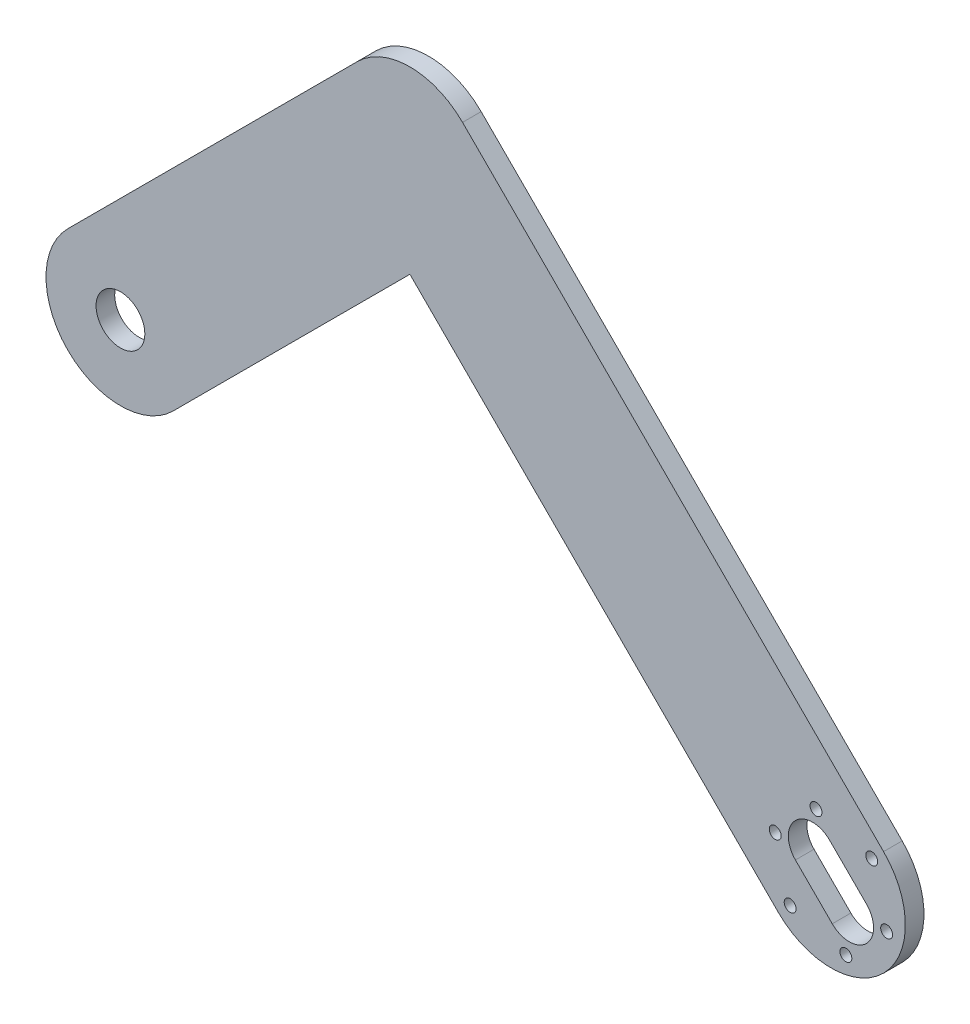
ISO-10303-21;
HEADER;
FILE_DESCRIPTION(('STEP AP214'),'2;1');
FILE_NAME('part.step','',(''),(''),'','','');
FILE_SCHEMA(('AUTOMOTIVE_DESIGN { 1 0 10303 214 1 1 1 1 }'));
ENDSEC;
DATA;
#1=APPLICATION_CONTEXT('core data for automotive mechanical design processes');
#2=APPLICATION_PROTOCOL_DEFINITION('international standard','automotive_design',2000,#1);
#3=PRODUCT_CONTEXT('',#1,'mechanical');
#4=PRODUCT('Part','Part','',(#3));
#5=PRODUCT_RELATED_PRODUCT_CATEGORY('part','',(#4));
#6=PRODUCT_DEFINITION_FORMATION('','',#4);
#7=PRODUCT_DEFINITION_CONTEXT('part definition',#1,'design');
#8=PRODUCT_DEFINITION('design','',#6,#7);
#9=PRODUCT_DEFINITION_SHAPE('','',#8);
#10=(LENGTH_UNIT() NAMED_UNIT(*) SI_UNIT(.MILLI.,.METRE.));
#11=(NAMED_UNIT(*) PLANE_ANGLE_UNIT() SI_UNIT($,.RADIAN.));
#12=(NAMED_UNIT(*) SI_UNIT($,.STERADIAN.) SOLID_ANGLE_UNIT());
#13=UNCERTAINTY_MEASURE_WITH_UNIT(LENGTH_MEASURE(1.E-05),#10,'distance_accuracy_value','');
#14=(GEOMETRIC_REPRESENTATION_CONTEXT(3) GLOBAL_UNCERTAINTY_ASSIGNED_CONTEXT((#13)) GLOBAL_UNIT_ASSIGNED_CONTEXT((#10,
#11,#12)) REPRESENTATION_CONTEXT('',''));
#15=CARTESIAN_POINT('',(0.,0.,0.));
#16=DIRECTION('',(0.,0.,1.));
#17=DIRECTION('',(1.,0.,0.));
#18=AXIS2_PLACEMENT_3D('',#15,#16,#17);
#19=CARTESIAN_POINT('',(63.6396103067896,63.639610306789,5.));
#20=DIRECTION('',(0.707106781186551,0.707106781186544,0.));
#21=DIRECTION('',(-0.707106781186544,0.707106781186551,0.));
#22=AXIS2_PLACEMENT_3D('',#19,#20,#21);
#23=PLANE('',#22);
#24=DIRECTION('',(0.707106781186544,-0.707106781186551,0.));
#25=VECTOR('',#24,1.);
#26=CARTESIAN_POINT('',(63.6396103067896,63.639610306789,0.));
#27=LINE('',#26,#25);
#28=CARTESIAN_POINT('',(77.7817459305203,49.4974746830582,0.));
#29=VERTEX_POINT('',#28);
#30=CARTESIAN_POINT('',(176.776695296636,-49.4974746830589,0.));
#31=VERTEX_POINT('',#30);
#32=EDGE_CURVE('E226',#29,#31,#27,.T.);
#33=ORIENTED_EDGE('',*,*,#32,.T.);
#34=DIRECTION('',(0.,0.,-1.));
#35=VECTOR('',#34,1.);
#36=CARTESIAN_POINT('',(176.776695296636,-49.4974746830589,5.));
#37=LINE('',#36,#35);
#38=CARTESIAN_POINT('',(176.776695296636,-49.4974746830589,5.));
#39=VERTEX_POINT('',#38);
#40=EDGE_CURVE('E77',#39,#31,#37,.T.);
#41=ORIENTED_EDGE('',*,*,#40,.F.);
#42=DIRECTION('',(0.707106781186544,-0.707106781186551,0.));
#43=VECTOR('',#42,1.);
#44=CARTESIAN_POINT('',(63.6396103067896,63.639610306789,5.));
#45=LINE('',#44,#43);
#46=CARTESIAN_POINT('',(77.7817459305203,49.4974746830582,5.));
#47=VERTEX_POINT('',#46);
#48=EDGE_CURVE('E211',#47,#39,#45,.T.);
#49=ORIENTED_EDGE('',*,*,#48,.F.);
#50=DIRECTION('',(0.,0.,-1.));
#51=VECTOR('',#50,1.);
#52=CARTESIAN_POINT('',(77.7817459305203,49.4974746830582,5.));
#53=LINE('',#52,#51);
#54=EDGE_CURVE('E12',#47,#29,#53,.T.);
#55=ORIENTED_EDGE('',*,*,#54,.T.);
#56=EDGE_LOOP('',(#33,#41,#49,#55));
#57=FACE_BOUND('',#56,.T.);
#58=ADVANCED_FACE('F69',(#57),#23,.F.);
#59=CARTESIAN_POINT('',(190.918830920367,-35.3553390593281,5.));
#60=DIRECTION('',(0.,0.,-1.));
#61=DIRECTION('',(-1.,0.,0.));
#62=AXIS2_PLACEMENT_3D('',#59,#60,#61);
#63=CYLINDRICAL_SURFACE('',#62,19.9999999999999);
#64=CARTESIAN_POINT('',(190.918830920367,-35.3553390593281,0.));
#65=DIRECTION('',(0.,0.,1.));
#66=DIRECTION('',(1.,0.,0.));
#67=AXIS2_PLACEMENT_3D('',#64,#65,#66);
#68=CIRCLE('',#67,19.9999999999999);
#69=CARTESIAN_POINT('',(205.060966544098,-21.2132034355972,0.));
#70=VERTEX_POINT('',#69);
#71=EDGE_CURVE('E233',#31,#70,#68,.T.);
#72=ORIENTED_EDGE('',*,*,#71,.T.);
#73=DIRECTION('',(0.,0.,-1.));
#74=VECTOR('',#73,1.);
#75=CARTESIAN_POINT('',(205.060966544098,-21.2132034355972,5.));
#76=LINE('',#75,#74);
#77=CARTESIAN_POINT('',(205.060966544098,-21.2132034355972,5.));
#78=VERTEX_POINT('',#77);
#79=EDGE_CURVE('E248',#78,#70,#76,.T.);
#80=ORIENTED_EDGE('',*,*,#79,.F.);
#81=CARTESIAN_POINT('',(190.918830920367,-35.3553390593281,5.));
#82=DIRECTION('',(0.,0.,1.));
#83=DIRECTION('',(1.,0.,0.));
#84=AXIS2_PLACEMENT_3D('',#81,#82,#83);
#85=CIRCLE('',#84,19.9999999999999);
#86=EDGE_CURVE('E213',#39,#78,#85,.T.);
#87=ORIENTED_EDGE('',*,*,#86,.F.);
#88=ORIENTED_EDGE('',*,*,#40,.T.);
#89=EDGE_LOOP('',(#72,#80,#87,#88));
#90=FACE_BOUND('',#89,.T.);
#91=ADVANCED_FACE('F276',(#90),#63,.T.);
#92=CARTESIAN_POINT('',(91.9238815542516,91.9238815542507,5.));
#93=DIRECTION('',(0.707106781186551,0.707106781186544,0.));
#94=DIRECTION('',(-0.707106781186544,0.707106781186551,0.));
#95=AXIS2_PLACEMENT_3D('',#92,#93,#94);
#96=PLANE('',#95);
#97=DIRECTION('',(0.707106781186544,-0.707106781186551,0.));
#98=VECTOR('',#97,1.);
#99=CARTESIAN_POINT('',(91.9238815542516,91.9238815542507,0.));
#100=LINE('',#99,#98);
#101=CARTESIAN_POINT('',(91.9238815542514,91.923881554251,0.));
#102=VERTEX_POINT('',#101);
#103=EDGE_CURVE('E234',#102,#70,#100,.T.);
#104=ORIENTED_EDGE('',*,*,#103,.F.);
#105=DIRECTION('',(0.,0.,-1.));
#106=VECTOR('',#105,1.);
#107=CARTESIAN_POINT('',(91.9238815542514,91.923881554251,5.));
#108=LINE('',#107,#106);
#109=CARTESIAN_POINT('',(91.9238815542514,91.923881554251,5.));
#110=VERTEX_POINT('',#109);
#111=EDGE_CURVE('E250',#110,#102,#108,.T.);
#112=ORIENTED_EDGE('',*,*,#111,.F.);
#113=DIRECTION('',(0.707106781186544,-0.707106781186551,0.));
#114=VECTOR('',#113,1.);
#115=CARTESIAN_POINT('',(91.9238815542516,91.9238815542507,5.));
#116=LINE('',#115,#114);
#117=EDGE_CURVE('E217',#110,#78,#116,.T.);
#118=ORIENTED_EDGE('',*,*,#117,.T.);
#119=ORIENTED_EDGE('',*,*,#79,.T.);
#120=EDGE_LOOP('',(#104,#112,#118,#119));
#121=FACE_BOUND('',#120,.T.);
#122=ADVANCED_FACE('F271',(#121),#96,.T.);
#123=CARTESIAN_POINT('',(-14.1421356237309,14.142135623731,5.));
#124=DIRECTION('',(-0.707106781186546,0.707106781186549,0.));
#125=DIRECTION('',(-0.707106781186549,-0.707106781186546,0.));
#126=AXIS2_PLACEMENT_3D('',#123,#124,#125);
#127=PLANE('',#126);
#128=DIRECTION('',(0.707106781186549,0.707106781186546,0.));
#129=VECTOR('',#128,1.);
#130=CARTESIAN_POINT('',(-14.1421356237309,14.142135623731,0.));
#131=LINE('',#130,#129);
#132=CARTESIAN_POINT('',(-14.1421356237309,14.142135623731,0.));
#133=VERTEX_POINT('',#132);
#134=CARTESIAN_POINT('',(63.6396103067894,91.9238815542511,0.));
#135=VERTEX_POINT('',#134);
#136=EDGE_CURVE('E240',#133,#135,#131,.T.);
#137=ORIENTED_EDGE('',*,*,#136,.F.);
#138=DIRECTION('',(0.,0.,-1.));
#139=VECTOR('',#138,1.);
#140=CARTESIAN_POINT('',(-14.1421356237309,14.142135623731,5.));
#141=LINE('',#140,#139);
#142=CARTESIAN_POINT('',(-14.1421356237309,14.142135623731,5.));
#143=VERTEX_POINT('',#142);
#144=EDGE_CURVE('E243',#143,#133,#141,.T.);
#145=ORIENTED_EDGE('',*,*,#144,.F.);
#146=DIRECTION('',(0.707106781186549,0.707106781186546,0.));
#147=VECTOR('',#146,1.);
#148=CARTESIAN_POINT('',(-14.1421356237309,14.142135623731,5.));
#149=LINE('',#148,#147);
#150=CARTESIAN_POINT('',(63.6396103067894,91.9238815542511,5.));
#151=VERTEX_POINT('',#150);
#152=EDGE_CURVE('E216',#143,#151,#149,.T.);
#153=ORIENTED_EDGE('',*,*,#152,.T.);
#154=DIRECTION('',(0.,0.,-1.));
#155=VECTOR('',#154,1.);
#156=CARTESIAN_POINT('',(63.6396103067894,91.9238815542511,5.));
#157=LINE('',#156,#155);
#158=EDGE_CURVE('E244',#151,#135,#157,.T.);
#159=ORIENTED_EDGE('',*,*,#158,.T.);
#160=EDGE_LOOP('',(#137,#145,#153,#159));
#161=FACE_BOUND('',#160,.T.);
#162=ADVANCED_FACE('F263',(#161),#127,.T.);
#163=CARTESIAN_POINT('',(0.,0.,5.));
#164=DIRECTION('',(0.,0.,-1.));
#165=DIRECTION('',(-1.,0.,0.));
#166=AXIS2_PLACEMENT_3D('',#163,#164,#165);
#167=CYLINDRICAL_SURFACE('',#166,20.);
#168=CARTESIAN_POINT('',(0.,0.,0.));
#169=DIRECTION('',(0.,0.,1.));
#170=DIRECTION('',(1.,0.,0.));
#171=AXIS2_PLACEMENT_3D('',#168,#169,#170);
#172=CIRCLE('',#171,20.);
#173=CARTESIAN_POINT('',(14.1421356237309,-14.142135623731,0.));
#174=VERTEX_POINT('',#173);
#175=EDGE_CURVE('E215',#133,#174,#172,.T.);
#176=ORIENTED_EDGE('',*,*,#175,.T.);
#177=DIRECTION('',(0.,0.,-1.));
#178=VECTOR('',#177,1.);
#179=CARTESIAN_POINT('',(14.1421356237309,-14.142135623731,5.));
#180=LINE('',#179,#178);
#181=CARTESIAN_POINT('',(14.1421356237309,-14.142135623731,5.));
#182=VERTEX_POINT('',#181);
#183=EDGE_CURVE('E224',#182,#174,#180,.T.);
#184=ORIENTED_EDGE('',*,*,#183,.F.);
#185=CARTESIAN_POINT('',(0.,0.,5.));
#186=DIRECTION('',(0.,0.,1.));
#187=DIRECTION('',(1.,0.,0.));
#188=AXIS2_PLACEMENT_3D('',#185,#186,#187);
#189=CIRCLE('',#188,20.);
#190=EDGE_CURVE('E225',#143,#182,#189,.T.);
#191=ORIENTED_EDGE('',*,*,#190,.F.);
#192=ORIENTED_EDGE('',*,*,#144,.T.);
#193=EDGE_LOOP('',(#176,#184,#191,#192));
#194=FACE_BOUND('',#193,.T.);
#195=ADVANCED_FACE('F281',(#194),#167,.T.);
#196=CARTESIAN_POINT('',(14.1421356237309,-14.142135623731,5.));
#197=DIRECTION('',(-0.707106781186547,0.707106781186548,0.));
#198=DIRECTION('',(-0.707106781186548,-0.707106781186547,0.));
#199=AXIS2_PLACEMENT_3D('',#196,#197,#198);
#200=PLANE('',#199);
#201=DIRECTION('',(0.707106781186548,0.707106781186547,0.));
#202=VECTOR('',#201,1.);
#203=CARTESIAN_POINT('',(14.1421356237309,-14.142135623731,0.));
#204=LINE('',#203,#202);
#205=EDGE_CURVE('E222',#174,#29,#204,.T.);
#206=ORIENTED_EDGE('',*,*,#205,.T.);
#207=ORIENTED_EDGE('',*,*,#54,.F.);
#208=DIRECTION('',(0.707106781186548,0.707106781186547,0.));
#209=VECTOR('',#208,1.);
#210=CARTESIAN_POINT('',(14.1421356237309,-14.142135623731,5.));
#211=LINE('',#210,#209);
#212=EDGE_CURVE('E206',#182,#47,#211,.T.);
#213=ORIENTED_EDGE('',*,*,#212,.F.);
#214=ORIENTED_EDGE('',*,*,#183,.T.);
#215=EDGE_LOOP('',(#206,#207,#213,#214));
#216=FACE_BOUND('',#215,.T.);
#217=ADVANCED_FACE('F284',(#216),#200,.F.);
#218=CARTESIAN_POINT('',(0.,0.,0.));
#219=DIRECTION('',(0.,0.,1.));
#220=DIRECTION('',(1.,0.,0.));
#221=AXIS2_PLACEMENT_3D('',#218,#219,#220);
#222=PLANE('',#221);
#223=CARTESIAN_POINT('',(0.,0.,0.));
#224=DIRECTION('',(0.,0.,-1.));
#225=DIRECTION('',(-1.,0.,0.));
#226=AXIS2_PLACEMENT_3D('',#223,#224,#225);
#227=CIRCLE('',#226,6.55);
#228=CARTESIAN_POINT('',(-6.55,0.,0.));
#229=VERTEX_POINT('',#228);
#230=EDGE_CURVE('E522',#229,#229,#227,.T.);
#231=ORIENTED_EDGE('',*,*,#230,.F.);
#232=EDGE_LOOP('',(#231));
#233=FACE_BOUND('',#232,.T.);
#234=CARTESIAN_POINT('',(186.907135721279,-20.3834887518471,0.));
#235=DIRECTION('',(0.,0.,1.));
#236=DIRECTION('',(1.,0.,0.));
#237=AXIS2_PLACEMENT_3D('',#234,#235,#236);
#238=CIRCLE('',#237,1.6);
#239=CARTESIAN_POINT('',(188.507135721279,-20.3834887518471,0.));
#240=VERTEX_POINT('',#239);
#241=EDGE_CURVE('E204',#240,#240,#238,.T.);
#242=ORIENTED_EDGE('',*,*,#241,.T.);
#243=EDGE_LOOP('',(#242));
#244=FACE_BOUND('',#243,.T.);
#245=CARTESIAN_POINT('',(201.87898602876,-24.3951839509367,0.));
#246=DIRECTION('',(0.,0.,1.));
#247=DIRECTION('',(1.,0.,0.));
#248=AXIS2_PLACEMENT_3D('',#245,#246,#247);
#249=CIRCLE('',#248,1.6);
#250=CARTESIAN_POINT('',(203.47898602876,-24.3951839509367,0.));
#251=VERTEX_POINT('',#250);
#252=EDGE_CURVE('E203',#251,#251,#249,.T.);
#253=ORIENTED_EDGE('',*,*,#252,.T.);
#254=EDGE_LOOP('',(#253));
#255=FACE_BOUND('',#254,.T.);
#256=CARTESIAN_POINT('',(205.890681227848,-39.3670342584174,0.));
#257=DIRECTION('',(0.,0.,1.));
#258=DIRECTION('',(1.,0.,0.));
#259=AXIS2_PLACEMENT_3D('',#256,#257,#258);
#260=CIRCLE('',#259,1.59999999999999);
#261=CARTESIAN_POINT('',(207.490681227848,-39.3670342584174,0.));
#262=VERTEX_POINT('',#261);
#263=EDGE_CURVE('E200',#262,#262,#260,.T.);
#264=ORIENTED_EDGE('',*,*,#263,.T.);
#265=EDGE_LOOP('',(#264));
#266=FACE_BOUND('',#265,.T.);
#267=CARTESIAN_POINT('',(194.930526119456,-50.3271893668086,0.));
#268=DIRECTION('',(0.,0.,1.));
#269=DIRECTION('',(1.,0.,0.));
#270=AXIS2_PLACEMENT_3D('',#267,#268,#269);
#271=CIRCLE('',#270,1.6);
#272=CARTESIAN_POINT('',(196.530526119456,-50.3271893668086,0.));
#273=VERTEX_POINT('',#272);
#274=EDGE_CURVE('E194',#273,#273,#271,.T.);
#275=ORIENTED_EDGE('',*,*,#274,.T.);
#276=EDGE_LOOP('',(#275));
#277=FACE_BOUND('',#276,.T.);
#278=CARTESIAN_POINT('',(179.958675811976,-46.3154941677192,0.));
#279=DIRECTION('',(0.,0.,1.));
#280=DIRECTION('',(1.,0.,0.));
#281=AXIS2_PLACEMENT_3D('',#278,#279,#280);
#282=CIRCLE('',#281,1.59999999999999);
#283=CARTESIAN_POINT('',(181.558675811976,-46.3154941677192,0.));
#284=VERTEX_POINT('',#283);
#285=EDGE_CURVE('E195',#284,#284,#282,.T.);
#286=ORIENTED_EDGE('',*,*,#285,.T.);
#287=EDGE_LOOP('',(#286));
#288=FACE_BOUND('',#287,.T.);
#289=CARTESIAN_POINT('',(175.946980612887,-31.3436438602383,0.));
#290=DIRECTION('',(0.,0.,1.));
#291=DIRECTION('',(1.,0.,0.));
#292=AXIS2_PLACEMENT_3D('',#289,#290,#291);
#293=CIRCLE('',#292,1.60000000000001);
#294=CARTESIAN_POINT('',(177.546980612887,-31.3436438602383,0.));
#295=VERTEX_POINT('',#294);
#296=EDGE_CURVE('E186',#295,#295,#293,.T.);
#297=ORIENTED_EDGE('',*,*,#296,.T.);
#298=EDGE_LOOP('',(#297));
#299=FACE_BOUND('',#298,.T.);
#300=DIRECTION('',(-0.707106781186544,0.707106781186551,0.));
#301=VECTOR('',#300,1.);
#302=CARTESIAN_POINT('',(82.3779400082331,82.3779400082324,0.));
#303=LINE('',#302,#301);
#304=CARTESIAN_POINT('',(200.464772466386,-35.7088924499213,0.));
#305=VERTEX_POINT('',#304);
#306=CARTESIAN_POINT('',(190.565277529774,-25.8093975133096,0.));
#307=VERTEX_POINT('',#306);
#308=EDGE_CURVE('E182',#305,#307,#303,.T.);
#309=ORIENTED_EDGE('',*,*,#308,.T.);
#310=CARTESIAN_POINT('',(185.969083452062,-30.4055915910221,0.));
#311=DIRECTION('',(0.,0.,1.));
#312=DIRECTION('',(1.,0.,0.));
#313=AXIS2_PLACEMENT_3D('',#310,#311,#312);
#314=CIRCLE('',#313,6.5);
#315=CARTESIAN_POINT('',(181.372889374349,-35.0017856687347,0.));
#316=VERTEX_POINT('',#315);
#317=EDGE_CURVE('E187',#307,#316,#314,.T.);
#318=ORIENTED_EDGE('',*,*,#317,.T.);
#319=DIRECTION('',(0.707106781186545,-0.707106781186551,0.));
#320=VECTOR('',#319,1.);
#321=CARTESIAN_POINT('',(73.1855518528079,73.1855518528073,0.));
#322=LINE('',#321,#320);
#323=CARTESIAN_POINT('',(191.272384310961,-44.9012806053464,0.));
#324=VERTEX_POINT('',#323);
#325=EDGE_CURVE('E178',#316,#324,#322,.T.);
#326=ORIENTED_EDGE('',*,*,#325,.T.);
#327=CARTESIAN_POINT('',(195.868578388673,-40.3050865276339,0.));
#328=DIRECTION('',(0.,0.,1.));
#329=DIRECTION('',(1.,0.,0.));
#330=AXIS2_PLACEMENT_3D('',#327,#328,#329);
#331=CIRCLE('',#330,6.5);
#332=EDGE_CURVE('E156',#324,#305,#331,.T.);
#333=ORIENTED_EDGE('',*,*,#332,.T.);
#334=EDGE_LOOP('',(#309,#318,#326,#333));
#335=FACE_BOUND('',#334,.T.);
#336=ORIENTED_EDGE('',*,*,#205,.F.);
#337=ORIENTED_EDGE('',*,*,#175,.F.);
#338=ORIENTED_EDGE('',*,*,#136,.T.);
#339=CARTESIAN_POINT('',(77.7817459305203,77.7817459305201,0.));
#340=DIRECTION('',(0.,0.,1.));
#341=DIRECTION('',(1.,0.,0.));
#342=AXIS2_PLACEMENT_3D('',#339,#340,#341);
#343=CIRCLE('',#342,20.);
#344=EDGE_CURVE('E210',#102,#135,#343,.T.);
#345=ORIENTED_EDGE('',*,*,#344,.F.);
#346=ORIENTED_EDGE('',*,*,#103,.T.);
#347=ORIENTED_EDGE('',*,*,#71,.F.);
#348=ORIENTED_EDGE('',*,*,#32,.F.);
#349=EDGE_LOOP('',(#336,#337,#338,#345,#346,#347,#348));
#350=FACE_BOUND('',#349,.T.);
#351=ADVANCED_FACE('F265',(#233,#244,#255,#266,#277,#288,#299,#335,#350),#222,.F.);
#352=CARTESIAN_POINT('',(0.,0.,5.));
#353=DIRECTION('',(0.,0.,1.));
#354=DIRECTION('',(1.,0.,0.));
#355=AXIS2_PLACEMENT_3D('',#352,#353,#354);
#356=PLANE('',#355);
#357=CARTESIAN_POINT('',(0.,0.,5.));
#358=DIRECTION('',(0.,0.,1.));
#359=DIRECTION('',(1.,0.,0.));
#360=AXIS2_PLACEMENT_3D('',#357,#358,#359);
#361=CIRCLE('',#360,6.55);
#362=CARTESIAN_POINT('',(6.55,0.,5.));
#363=VERTEX_POINT('',#362);
#364=EDGE_CURVE('E73',#363,#363,#361,.T.);
#365=ORIENTED_EDGE('',*,*,#364,.F.);
#366=EDGE_LOOP('',(#365));
#367=FACE_BOUND('',#366,.T.);
#368=CARTESIAN_POINT('',(186.907135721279,-20.3834887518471,5.));
#369=DIRECTION('',(0.,0.,1.));
#370=DIRECTION('',(1.,0.,0.));
#371=AXIS2_PLACEMENT_3D('',#368,#369,#370);
#372=CIRCLE('',#371,1.6);
#373=CARTESIAN_POINT('',(188.507135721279,-20.3834887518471,5.));
#374=VERTEX_POINT('',#373);
#375=EDGE_CURVE('E525',#374,#374,#372,.T.);
#376=ORIENTED_EDGE('',*,*,#375,.F.);
#377=EDGE_LOOP('',(#376));
#378=FACE_BOUND('',#377,.T.);
#379=CARTESIAN_POINT('',(201.87898602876,-24.3951839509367,5.));
#380=DIRECTION('',(0.,0.,1.));
#381=DIRECTION('',(1.,0.,0.));
#382=AXIS2_PLACEMENT_3D('',#379,#380,#381);
#383=CIRCLE('',#382,1.6);
#384=CARTESIAN_POINT('',(203.47898602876,-24.3951839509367,5.));
#385=VERTEX_POINT('',#384);
#386=EDGE_CURVE('E540',#385,#385,#383,.T.);
#387=ORIENTED_EDGE('',*,*,#386,.F.);
#388=EDGE_LOOP('',(#387));
#389=FACE_BOUND('',#388,.T.);
#390=CARTESIAN_POINT('',(205.890681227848,-39.3670342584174,5.));
#391=DIRECTION('',(0.,0.,1.));
#392=DIRECTION('',(1.,0.,0.));
#393=AXIS2_PLACEMENT_3D('',#390,#391,#392);
#394=CIRCLE('',#393,1.59999999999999);
#395=CARTESIAN_POINT('',(207.490681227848,-39.3670342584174,5.));
#396=VERTEX_POINT('',#395);
#397=EDGE_CURVE('E534',#396,#396,#394,.T.);
#398=ORIENTED_EDGE('',*,*,#397,.F.);
#399=EDGE_LOOP('',(#398));
#400=FACE_BOUND('',#399,.T.);
#401=CARTESIAN_POINT('',(194.930526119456,-50.3271893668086,5.));
#402=DIRECTION('',(0.,0.,1.));
#403=DIRECTION('',(1.,0.,0.));
#404=AXIS2_PLACEMENT_3D('',#401,#402,#403);
#405=CIRCLE('',#404,1.6);
#406=CARTESIAN_POINT('',(196.530526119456,-50.3271893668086,5.));
#407=VERTEX_POINT('',#406);
#408=EDGE_CURVE('E532',#407,#407,#405,.T.);
#409=ORIENTED_EDGE('',*,*,#408,.F.);
#410=EDGE_LOOP('',(#409));
#411=FACE_BOUND('',#410,.T.);
#412=CARTESIAN_POINT('',(179.958675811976,-46.3154941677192,5.));
#413=DIRECTION('',(0.,0.,1.));
#414=DIRECTION('',(1.,0.,0.));
#415=AXIS2_PLACEMENT_3D('',#412,#413,#414);
#416=CIRCLE('',#415,1.59999999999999);
#417=CARTESIAN_POINT('',(181.558675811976,-46.3154941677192,5.));
#418=VERTEX_POINT('',#417);
#419=EDGE_CURVE('E526',#418,#418,#416,.T.);
#420=ORIENTED_EDGE('',*,*,#419,.F.);
#421=EDGE_LOOP('',(#420));
#422=FACE_BOUND('',#421,.T.);
#423=CARTESIAN_POINT('',(175.946980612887,-31.3436438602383,5.));
#424=DIRECTION('',(0.,0.,1.));
#425=DIRECTION('',(1.,0.,0.));
#426=AXIS2_PLACEMENT_3D('',#423,#424,#425);
#427=CIRCLE('',#426,1.60000000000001);
#428=CARTESIAN_POINT('',(177.546980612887,-31.3436438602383,5.));
#429=VERTEX_POINT('',#428);
#430=EDGE_CURVE('E523',#429,#429,#427,.T.);
#431=ORIENTED_EDGE('',*,*,#430,.F.);
#432=EDGE_LOOP('',(#431));
#433=FACE_BOUND('',#432,.T.);
#434=CARTESIAN_POINT('',(185.969083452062,-30.4055915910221,5.));
#435=DIRECTION('',(0.,0.,1.));
#436=DIRECTION('',(1.,0.,0.));
#437=AXIS2_PLACEMENT_3D('',#434,#435,#436);
#438=CIRCLE('',#437,6.5);
#439=CARTESIAN_POINT('',(190.565277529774,-25.8093975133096,5.));
#440=VERTEX_POINT('',#439);
#441=CARTESIAN_POINT('',(181.372889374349,-35.0017856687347,5.));
#442=VERTEX_POINT('',#441);
#443=EDGE_CURVE('E95',#440,#442,#438,.T.);
#444=ORIENTED_EDGE('',*,*,#443,.F.);
#445=DIRECTION('',(-0.707106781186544,0.707106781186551,0.));
#446=VECTOR('',#445,1.);
#447=CARTESIAN_POINT('',(190.565277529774,-25.8093975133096,5.));
#448=LINE('',#447,#446);
#449=CARTESIAN_POINT('',(200.464772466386,-35.7088924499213,5.));
#450=VERTEX_POINT('',#449);
#451=EDGE_CURVE('E171',#450,#440,#448,.T.);
#452=ORIENTED_EDGE('',*,*,#451,.F.);
#453=CARTESIAN_POINT('',(195.868578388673,-40.3050865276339,5.));
#454=DIRECTION('',(0.,0.,1.));
#455=DIRECTION('',(1.,0.,0.));
#456=AXIS2_PLACEMENT_3D('',#453,#454,#455);
#457=CIRCLE('',#456,6.5);
#458=CARTESIAN_POINT('',(191.272384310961,-44.9012806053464,5.));
#459=VERTEX_POINT('',#458);
#460=EDGE_CURVE('E153',#459,#450,#457,.T.);
#461=ORIENTED_EDGE('',*,*,#460,.F.);
#462=DIRECTION('',(0.707106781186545,-0.707106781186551,0.));
#463=VECTOR('',#462,1.);
#464=CARTESIAN_POINT('',(191.272384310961,-44.9012806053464,5.));
#465=LINE('',#464,#463);
#466=EDGE_CURVE('E165',#442,#459,#465,.T.);
#467=ORIENTED_EDGE('',*,*,#466,.F.);
#468=EDGE_LOOP('',(#444,#452,#461,#467));
#469=FACE_BOUND('',#468,.T.);
#470=ORIENTED_EDGE('',*,*,#212,.T.);
#471=ORIENTED_EDGE('',*,*,#48,.T.);
#472=ORIENTED_EDGE('',*,*,#86,.T.);
#473=ORIENTED_EDGE('',*,*,#117,.F.);
#474=CARTESIAN_POINT('',(77.7817459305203,77.7817459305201,5.));
#475=DIRECTION('',(0.,0.,1.));
#476=DIRECTION('',(1.,0.,0.));
#477=AXIS2_PLACEMENT_3D('',#474,#475,#476);
#478=CIRCLE('',#477,20.);
#479=EDGE_CURVE('E230',#110,#151,#478,.T.);
#480=ORIENTED_EDGE('',*,*,#479,.T.);
#481=ORIENTED_EDGE('',*,*,#152,.F.);
#482=ORIENTED_EDGE('',*,*,#190,.T.);
#483=EDGE_LOOP('',(#470,#471,#472,#473,#480,#481,#482));
#484=FACE_BOUND('',#483,.T.);
#485=ADVANCED_FACE('F166',(#367,#378,#389,#400,#411,#422,#433,#469,#484),#356,.T.);
#486=CARTESIAN_POINT('',(77.7817459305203,77.7817459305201,5.));
#487=DIRECTION('',(0.,0.,-1.));
#488=DIRECTION('',(-1.,0.,0.));
#489=AXIS2_PLACEMENT_3D('',#486,#487,#488);
#490=CYLINDRICAL_SURFACE('',#489,20.);
#491=ORIENTED_EDGE('',*,*,#111,.T.);
#492=ORIENTED_EDGE('',*,*,#344,.T.);
#493=ORIENTED_EDGE('',*,*,#158,.F.);
#494=ORIENTED_EDGE('',*,*,#479,.F.);
#495=EDGE_LOOP('',(#491,#492,#493,#494));
#496=FACE_BOUND('',#495,.T.);
#497=ADVANCED_FACE('F66',(#496),#490,.T.);
#498=CARTESIAN_POINT('',(185.969083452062,-30.4055915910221,-5.));
#499=DIRECTION('',(0.,0.,1.));
#500=DIRECTION('',(1.,0.,0.));
#501=AXIS2_PLACEMENT_3D('',#498,#499,#500);
#502=CYLINDRICAL_SURFACE('',#501,6.5);
#503=DIRECTION('',(0.,0.,1.));
#504=VECTOR('',#503,1.);
#505=CARTESIAN_POINT('',(190.565277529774,-25.8093975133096,-5.));
#506=LINE('',#505,#504);
#507=EDGE_CURVE('E176',#307,#440,#506,.T.);
#508=ORIENTED_EDGE('',*,*,#507,.T.);
#509=ORIENTED_EDGE('',*,*,#443,.T.);
#510=DIRECTION('',(0.,0.,1.));
#511=VECTOR('',#510,1.);
#512=CARTESIAN_POINT('',(181.372889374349,-35.0017856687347,-5.));
#513=LINE('',#512,#511);
#514=EDGE_CURVE('E163',#316,#442,#513,.T.);
#515=ORIENTED_EDGE('',*,*,#514,.F.);
#516=ORIENTED_EDGE('',*,*,#317,.F.);
#517=EDGE_LOOP('',(#508,#509,#515,#516));
#518=FACE_BOUND('',#517,.T.);
#519=ADVANCED_FACE('F391',(#518),#502,.F.);
#520=CARTESIAN_POINT('',(190.565277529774,-25.8093975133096,-5.));
#521=DIRECTION('',(0.707106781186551,0.707106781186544,0.));
#522=DIRECTION('',(-0.707106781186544,0.707106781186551,0.));
#523=AXIS2_PLACEMENT_3D('',#520,#521,#522);
#524=PLANE('',#523);
#525=DIRECTION('',(0.,0.,1.));
#526=VECTOR('',#525,1.);
#527=CARTESIAN_POINT('',(200.464772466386,-35.7088924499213,-5.));
#528=LINE('',#527,#526);
#529=EDGE_CURVE('E157',#305,#450,#528,.T.);
#530=ORIENTED_EDGE('',*,*,#529,.T.);
#531=ORIENTED_EDGE('',*,*,#451,.T.);
#532=ORIENTED_EDGE('',*,*,#507,.F.);
#533=ORIENTED_EDGE('',*,*,#308,.F.);
#534=EDGE_LOOP('',(#530,#531,#532,#533));
#535=FACE_BOUND('',#534,.T.);
#536=ADVANCED_FACE('F405',(#535),#524,.F.);
#537=CARTESIAN_POINT('',(195.868578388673,-40.3050865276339,-5.));
#538=DIRECTION('',(0.,0.,1.));
#539=DIRECTION('',(1.,0.,0.));
#540=AXIS2_PLACEMENT_3D('',#537,#538,#539);
#541=CYLINDRICAL_SURFACE('',#540,6.5);
#542=DIRECTION('',(0.,0.,1.));
#543=VECTOR('',#542,1.);
#544=CARTESIAN_POINT('',(191.272384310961,-44.9012806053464,-5.));
#545=LINE('',#544,#543);
#546=EDGE_CURVE('E83',#324,#459,#545,.T.);
#547=ORIENTED_EDGE('',*,*,#546,.T.);
#548=ORIENTED_EDGE('',*,*,#460,.T.);
#549=ORIENTED_EDGE('',*,*,#529,.F.);
#550=ORIENTED_EDGE('',*,*,#332,.F.);
#551=EDGE_LOOP('',(#547,#548,#549,#550));
#552=FACE_BOUND('',#551,.T.);
#553=ADVANCED_FACE('F154',(#552),#541,.F.);
#554=CARTESIAN_POINT('',(191.272384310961,-44.9012806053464,-5.));
#555=DIRECTION('',(-0.707106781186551,-0.707106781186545,0.));
#556=DIRECTION('',(0.707106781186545,-0.707106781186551,0.));
#557=AXIS2_PLACEMENT_3D('',#554,#555,#556);
#558=PLANE('',#557);
#559=ORIENTED_EDGE('',*,*,#514,.T.);
#560=ORIENTED_EDGE('',*,*,#466,.T.);
#561=ORIENTED_EDGE('',*,*,#546,.F.);
#562=ORIENTED_EDGE('',*,*,#325,.F.);
#563=EDGE_LOOP('',(#559,#560,#561,#562));
#564=FACE_BOUND('',#563,.T.);
#565=ADVANCED_FACE('F164',(#564),#558,.F.);
#566=CARTESIAN_POINT('',(175.946980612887,-31.3436438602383,-5.));
#567=DIRECTION('',(0.,0.,1.));
#568=DIRECTION('',(1.,0.,0.));
#569=AXIS2_PLACEMENT_3D('',#566,#567,#568);
#570=CYLINDRICAL_SURFACE('',#569,1.60000000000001);
#571=ORIENTED_EDGE('',*,*,#430,.T.);
#572=EDGE_LOOP('',(#571));
#573=FACE_BOUND('',#572,.T.);
#574=ORIENTED_EDGE('',*,*,#296,.F.);
#575=EDGE_LOOP('',(#574));
#576=FACE_BOUND('',#575,.T.);
#577=ADVANCED_FACE('F426',(#573,#576),#570,.F.);
#578=CARTESIAN_POINT('',(179.958675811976,-46.3154941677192,-5.));
#579=DIRECTION('',(0.,0.,1.));
#580=DIRECTION('',(1.,0.,0.));
#581=AXIS2_PLACEMENT_3D('',#578,#579,#580);
#582=CYLINDRICAL_SURFACE('',#581,1.59999999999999);
#583=ORIENTED_EDGE('',*,*,#419,.T.);
#584=EDGE_LOOP('',(#583));
#585=FACE_BOUND('',#584,.T.);
#586=ORIENTED_EDGE('',*,*,#285,.F.);
#587=EDGE_LOOP('',(#586));
#588=FACE_BOUND('',#587,.T.);
#589=ADVANCED_FACE('F440',(#585,#588),#582,.F.);
#590=CARTESIAN_POINT('',(194.930526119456,-50.3271893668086,-5.));
#591=DIRECTION('',(0.,0.,1.));
#592=DIRECTION('',(1.,0.,0.));
#593=AXIS2_PLACEMENT_3D('',#590,#591,#592);
#594=CYLINDRICAL_SURFACE('',#593,1.6);
#595=ORIENTED_EDGE('',*,*,#408,.T.);
#596=EDGE_LOOP('',(#595));
#597=FACE_BOUND('',#596,.T.);
#598=ORIENTED_EDGE('',*,*,#274,.F.);
#599=EDGE_LOOP('',(#598));
#600=FACE_BOUND('',#599,.T.);
#601=ADVANCED_FACE('F448',(#597,#600),#594,.F.);
#602=CARTESIAN_POINT('',(205.890681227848,-39.3670342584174,-5.));
#603=DIRECTION('',(0.,0.,1.));
#604=DIRECTION('',(1.,0.,0.));
#605=AXIS2_PLACEMENT_3D('',#602,#603,#604);
#606=CYLINDRICAL_SURFACE('',#605,1.59999999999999);
#607=ORIENTED_EDGE('',*,*,#397,.T.);
#608=EDGE_LOOP('',(#607));
#609=FACE_BOUND('',#608,.T.);
#610=ORIENTED_EDGE('',*,*,#263,.F.);
#611=EDGE_LOOP('',(#610));
#612=FACE_BOUND('',#611,.T.);
#613=ADVANCED_FACE('F461',(#609,#612),#606,.F.);
#614=CARTESIAN_POINT('',(201.87898602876,-24.3951839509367,-5.));
#615=DIRECTION('',(0.,0.,1.));
#616=DIRECTION('',(1.,0.,0.));
#617=AXIS2_PLACEMENT_3D('',#614,#615,#616);
#618=CYLINDRICAL_SURFACE('',#617,1.6);
#619=ORIENTED_EDGE('',*,*,#386,.T.);
#620=EDGE_LOOP('',(#619));
#621=FACE_BOUND('',#620,.T.);
#622=ORIENTED_EDGE('',*,*,#252,.F.);
#623=EDGE_LOOP('',(#622));
#624=FACE_BOUND('',#623,.T.);
#625=ADVANCED_FACE('F477',(#621,#624),#618,.F.);
#626=CARTESIAN_POINT('',(186.907135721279,-20.3834887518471,-5.));
#627=DIRECTION('',(0.,0.,1.));
#628=DIRECTION('',(1.,0.,0.));
#629=AXIS2_PLACEMENT_3D('',#626,#627,#628);
#630=CYLINDRICAL_SURFACE('',#629,1.6);
#631=ORIENTED_EDGE('',*,*,#375,.T.);
#632=EDGE_LOOP('',(#631));
#633=FACE_BOUND('',#632,.T.);
#634=ORIENTED_EDGE('',*,*,#241,.F.);
#635=EDGE_LOOP('',(#634));
#636=FACE_BOUND('',#635,.T.);
#637=ADVANCED_FACE('F490',(#633,#636),#630,.F.);
#638=CARTESIAN_POINT('',(0.,0.,6.));
#639=DIRECTION('',(0.,0.,-1.));
#640=DIRECTION('',(-1.,0.,0.));
#641=AXIS2_PLACEMENT_3D('',#638,#639,#640);
#642=CYLINDRICAL_SURFACE('',#641,6.55);
#643=ORIENTED_EDGE('',*,*,#364,.T.);
#644=EDGE_LOOP('',(#643));
#645=FACE_BOUND('',#644,.T.);
#646=ORIENTED_EDGE('',*,*,#230,.T.);
#647=EDGE_LOOP('',(#646));
#648=FACE_BOUND('',#647,.T.);
#649=ADVANCED_FACE('F501',(#645,#648),#642,.F.);
#650=CLOSED_SHELL('',(#58,#91,#122,#162,#195,#217,#351,#485,#497,#519,#536,#553,#565,#577,#589,
#601,#613,#625,#637,#649));
#651=MANIFOLD_SOLID_BREP('B2',#650);
#652=ADVANCED_BREP_SHAPE_REPRESENTATION('',(#18,#651),#14);
#653=SHAPE_DEFINITION_REPRESENTATION(#9,#652);
ENDSEC;
END-ISO-10303-21;
